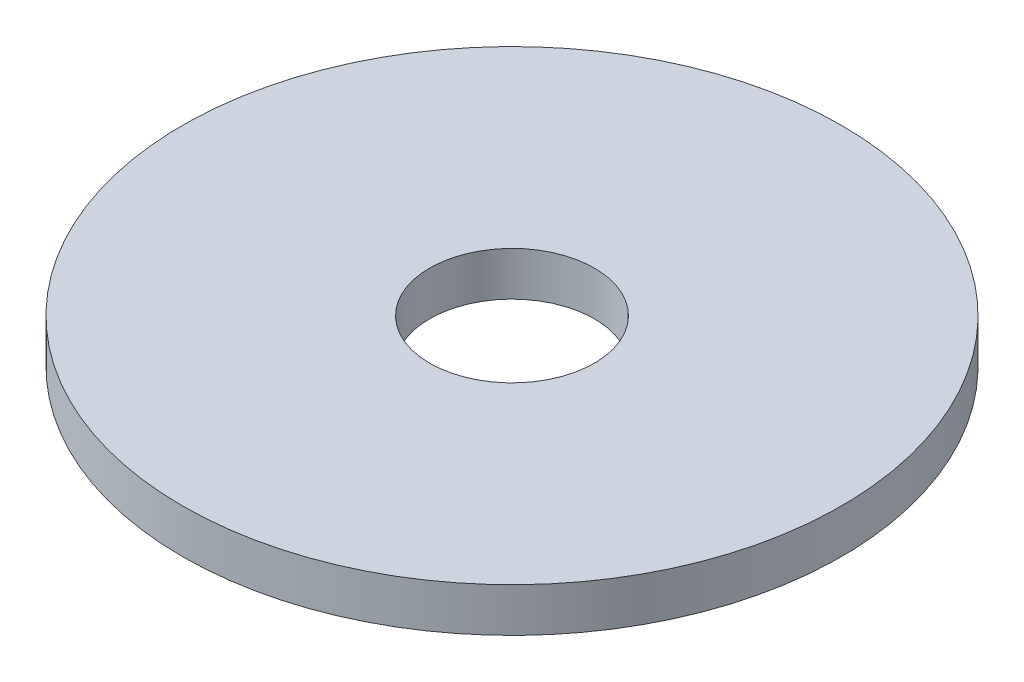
ISO-10303-21;
HEADER;
FILE_DESCRIPTION(('STEP AP214'),'2;1');
FILE_NAME('part.step','',(''),(''),'','','');
FILE_SCHEMA(('AUTOMOTIVE_DESIGN { 1 0 10303 214 1 1 1 1 }'));
ENDSEC;
DATA;
#1=APPLICATION_CONTEXT('core data for automotive mechanical design processes');
#2=APPLICATION_PROTOCOL_DEFINITION('international standard','automotive_design',2000,#1);
#3=PRODUCT_CONTEXT('',#1,'mechanical');
#4=PRODUCT('Part','Part','',(#3));
#5=PRODUCT_RELATED_PRODUCT_CATEGORY('part','',(#4));
#6=PRODUCT_DEFINITION_FORMATION('','',#4);
#7=PRODUCT_DEFINITION_CONTEXT('part definition',#1,'design');
#8=PRODUCT_DEFINITION('design','',#6,#7);
#9=PRODUCT_DEFINITION_SHAPE('','',#8);
#10=(LENGTH_UNIT() NAMED_UNIT(*) SI_UNIT(.MILLI.,.METRE.));
#11=(NAMED_UNIT(*) PLANE_ANGLE_UNIT() SI_UNIT($,.RADIAN.));
#12=(NAMED_UNIT(*) SI_UNIT($,.STERADIAN.) SOLID_ANGLE_UNIT());
#13=UNCERTAINTY_MEASURE_WITH_UNIT(LENGTH_MEASURE(1.E-05),#10,'distance_accuracy_value','');
#14=(GEOMETRIC_REPRESENTATION_CONTEXT(3) GLOBAL_UNCERTAINTY_ASSIGNED_CONTEXT((#13)) GLOBAL_UNIT_ASSIGNED_CONTEXT((#10,
#11,#12)) REPRESENTATION_CONTEXT('',''));
#15=CARTESIAN_POINT('',(0.,0.,0.));
#16=DIRECTION('',(0.,0.,1.));
#17=DIRECTION('',(1.,0.,0.));
#18=AXIS2_PLACEMENT_3D('',#15,#16,#17);
#19=CARTESIAN_POINT('',(0.,0.8,0.));
#20=DIRECTION('',(0.,1.,0.));
#21=DIRECTION('',(0.,0.,1.));
#22=AXIS2_PLACEMENT_3D('',#19,#20,#21);
#23=PLANE('',#22);
#24=CARTESIAN_POINT('',(0.,0.8,0.));
#25=DIRECTION('',(0.,1.,0.));
#26=DIRECTION('',(0.,0.,1.));
#27=AXIS2_PLACEMENT_3D('',#24,#25,#26);
#28=CIRCLE('',#27,6.);
#29=CARTESIAN_POINT('',(0.,0.8,6.));
#30=VERTEX_POINT('',#29);
#31=EDGE_CURVE('E10',#30,#30,#28,.T.);
#32=ORIENTED_EDGE('',*,*,#31,.T.);
#33=EDGE_LOOP('',(#32));
#34=FACE_BOUND('',#33,.T.);
#35=CARTESIAN_POINT('',(0.,0.8,0.));
#36=DIRECTION('',(0.,1.,0.));
#37=DIRECTION('',(0.,0.,1.));
#38=AXIS2_PLACEMENT_3D('',#35,#36,#37);
#39=CIRCLE('',#38,1.5);
#40=CARTESIAN_POINT('',(0.,0.8,1.5));
#41=VERTEX_POINT('',#40);
#42=EDGE_CURVE('E35',#41,#41,#39,.T.);
#43=ORIENTED_EDGE('',*,*,#42,.F.);
#44=EDGE_LOOP('',(#43));
#45=FACE_BOUND('',#44,.T.);
#46=ADVANCED_FACE('F24',(#34,#45),#23,.T.);
#47=CARTESIAN_POINT('',(0.,0.,0.));
#48=DIRECTION('',(0.,1.,0.));
#49=DIRECTION('',(0.,0.,1.));
#50=AXIS2_PLACEMENT_3D('',#47,#48,#49);
#51=PLANE('',#50);
#52=CARTESIAN_POINT('',(0.,0.,0.));
#53=DIRECTION('',(0.,1.,0.));
#54=DIRECTION('',(0.,0.,1.));
#55=AXIS2_PLACEMENT_3D('',#52,#53,#54);
#56=CIRCLE('',#55,6.);
#57=CARTESIAN_POINT('',(0.,0.,6.));
#58=VERTEX_POINT('',#57);
#59=EDGE_CURVE('E31',#58,#58,#56,.T.);
#60=ORIENTED_EDGE('',*,*,#59,.F.);
#61=EDGE_LOOP('',(#60));
#62=FACE_BOUND('',#61,.T.);
#63=CARTESIAN_POINT('',(0.,0.,0.));
#64=DIRECTION('',(0.,1.,0.));
#65=DIRECTION('',(0.,0.,1.));
#66=AXIS2_PLACEMENT_3D('',#63,#64,#65);
#67=CIRCLE('',#66,1.5);
#68=CARTESIAN_POINT('',(0.,0.,1.5));
#69=VERTEX_POINT('',#68);
#70=EDGE_CURVE('E39',#69,#69,#67,.T.);
#71=ORIENTED_EDGE('',*,*,#70,.T.);
#72=EDGE_LOOP('',(#71));
#73=FACE_BOUND('',#72,.T.);
#74=ADVANCED_FACE('F45',(#62,#73),#51,.F.);
#75=CARTESIAN_POINT('',(0.,0.8,0.));
#76=DIRECTION('',(0.,-1.,0.));
#77=DIRECTION('',(0.,0.,-1.));
#78=AXIS2_PLACEMENT_3D('',#75,#76,#77);
#79=CYLINDRICAL_SURFACE('',#78,6.);
#80=ORIENTED_EDGE('',*,*,#31,.F.);
#81=EDGE_LOOP('',(#80));
#82=FACE_BOUND('',#81,.T.);
#83=ORIENTED_EDGE('',*,*,#59,.T.);
#84=EDGE_LOOP('',(#83));
#85=FACE_BOUND('',#84,.T.);
#86=ADVANCED_FACE('F26',(#82,#85),#79,.T.);
#87=CARTESIAN_POINT('',(0.,0.8,0.));
#88=DIRECTION('',(0.,-1.,0.));
#89=DIRECTION('',(0.,0.,-1.));
#90=AXIS2_PLACEMENT_3D('',#87,#88,#89);
#91=CYLINDRICAL_SURFACE('',#90,1.5);
#92=ORIENTED_EDGE('',*,*,#42,.T.);
#93=EDGE_LOOP('',(#92));
#94=FACE_BOUND('',#93,.T.);
#95=ORIENTED_EDGE('',*,*,#70,.F.);
#96=EDGE_LOOP('',(#95));
#97=FACE_BOUND('',#96,.T.);
#98=ADVANCED_FACE('F47',(#94,#97),#91,.F.);
#99=CLOSED_SHELL('',(#46,#74,#86,#98));
#100=MANIFOLD_SOLID_BREP('B2',#99);
#101=ADVANCED_BREP_SHAPE_REPRESENTATION('',(#18,#100),#14);
#102=SHAPE_DEFINITION_REPRESENTATION(#9,#101);
ENDSEC;
END-ISO-10303-21;
